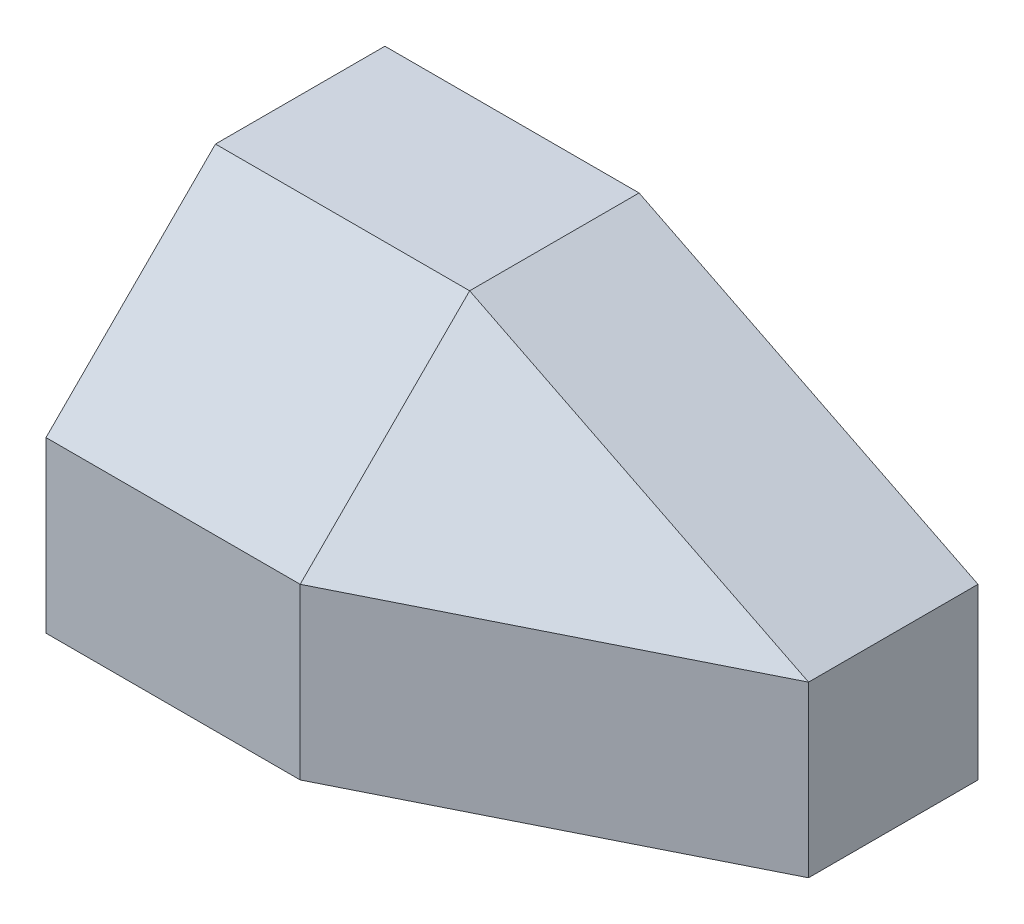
ISO-10303-21;
HEADER;
FILE_DESCRIPTION(('STEP AP214'),'2;1');
FILE_NAME('part.step','',(''),(''),'','','');
FILE_SCHEMA(('AUTOMOTIVE_DESIGN { 1 0 10303 214 1 1 1 1 }'));
ENDSEC;
DATA;
#1=APPLICATION_CONTEXT('core data for automotive mechanical design processes');
#2=APPLICATION_PROTOCOL_DEFINITION('international standard','automotive_design',2000,#1);
#3=PRODUCT_CONTEXT('',#1,'mechanical');
#4=PRODUCT('Part','Part','',(#3));
#5=PRODUCT_RELATED_PRODUCT_CATEGORY('part','',(#4));
#6=PRODUCT_DEFINITION_FORMATION('','',#4);
#7=PRODUCT_DEFINITION_CONTEXT('part definition',#1,'design');
#8=PRODUCT_DEFINITION('design','',#6,#7);
#9=PRODUCT_DEFINITION_SHAPE('','',#8);
#10=(LENGTH_UNIT() NAMED_UNIT(*) SI_UNIT(.MILLI.,.METRE.));
#11=(NAMED_UNIT(*) PLANE_ANGLE_UNIT() SI_UNIT($,.RADIAN.));
#12=(NAMED_UNIT(*) SI_UNIT($,.STERADIAN.) SOLID_ANGLE_UNIT());
#13=UNCERTAINTY_MEASURE_WITH_UNIT(LENGTH_MEASURE(1.E-05),#10,'distance_accuracy_value','');
#14=(GEOMETRIC_REPRESENTATION_CONTEXT(3) GLOBAL_UNCERTAINTY_ASSIGNED_CONTEXT((#13)) GLOBAL_UNIT_ASSIGNED_CONTEXT((#10,
#11,#12)) REPRESENTATION_CONTEXT('',''));
#15=CARTESIAN_POINT('',(0.,0.,0.));
#16=DIRECTION('',(0.,0.,1.));
#17=DIRECTION('',(1.,0.,0.));
#18=AXIS2_PLACEMENT_3D('',#15,#16,#17);
#19=CARTESIAN_POINT('',(29.9999999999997,40.,40.));
#20=DIRECTION('',(-0.447213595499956,0.,-0.894427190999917));
#21=DIRECTION('',(-0.894427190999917,0.,0.447213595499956));
#22=AXIS2_PLACEMENT_3D('',#19,#20,#21);
#23=PLANE('',#22);
#24=DIRECTION('',(0.,-1.,0.));
#25=VECTOR('',#24,1.);
#26=CARTESIAN_POINT('',(70.,0.,19.9999999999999));
#27=LINE('',#26,#25);
#28=CARTESIAN_POINT('',(70.,19.9999989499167,20.));
#29=VERTEX_POINT('',#28);
#30=CARTESIAN_POINT('',(70.,0.,19.9999999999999));
#31=VERTEX_POINT('',#30);
#32=EDGE_CURVE('E100',#29,#31,#27,.T.);
#33=ORIENTED_EDGE('',*,*,#32,.F.);
#34=DIRECTION('',(0.894427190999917,0.,-0.447213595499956));
#35=VECTOR('',#34,1.);
#36=CARTESIAN_POINT('',(29.9999999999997,19.9999989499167,40.));
#37=LINE('',#36,#35);
#38=CARTESIAN_POINT('',(29.9999999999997,19.9999999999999,40.));
#39=VERTEX_POINT('',#38);
#40=EDGE_CURVE('E11',#29,#39,#37,.F.);
#41=ORIENTED_EDGE('',*,*,#40,.T.);
#42=DIRECTION('',(0.,1.,0.));
#43=VECTOR('',#42,1.);
#44=CARTESIAN_POINT('',(29.9999999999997,40.,40.));
#45=LINE('',#44,#43);
#46=CARTESIAN_POINT('',(29.9999999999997,0.,40.));
#47=VERTEX_POINT('',#46);
#48=EDGE_CURVE('E103',#47,#39,#45,.T.);
#49=ORIENTED_EDGE('',*,*,#48,.F.);
#50=DIRECTION('',(0.894427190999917,0.,-0.447213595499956));
#51=VECTOR('',#50,1.);
#52=CARTESIAN_POINT('',(29.9999999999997,0.,40.));
#53=LINE('',#52,#51);
#54=EDGE_CURVE('E106',#31,#47,#53,.F.);
#55=ORIENTED_EDGE('',*,*,#54,.F.);
#56=EDGE_LOOP('',(#33,#41,#49,#55));
#57=FACE_BOUND('',#56,.T.);
#58=ADVANCED_FACE('F30',(#57),#23,.F.);
#59=CARTESIAN_POINT('',(29.9999999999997,40.,40.));
#60=DIRECTION('',(-0.447213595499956,-0.894427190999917,0.));
#61=DIRECTION('',(0.894427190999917,-0.447213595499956,0.));
#62=AXIS2_PLACEMENT_3D('',#59,#60,#61);
#63=PLANE('',#62);
#64=DIRECTION('',(0.,0.,-1.));
#65=VECTOR('',#64,1.);
#66=CARTESIAN_POINT('',(29.9999999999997,40.,40.));
#67=LINE('',#66,#65);
#68=CARTESIAN_POINT('',(29.9999999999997,40.,19.9999989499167));
#69=VERTEX_POINT('',#68);
#70=CARTESIAN_POINT('',(29.9999999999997,40.,0.));
#71=VERTEX_POINT('',#70);
#72=EDGE_CURVE('E45',#69,#71,#67,.T.);
#73=ORIENTED_EDGE('',*,*,#72,.F.);
#74=DIRECTION('',(-0.894427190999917,0.447213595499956,0.));
#75=VECTOR('',#74,1.);
#76=CARTESIAN_POINT('',(29.9999999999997,40.,19.9999989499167));
#77=LINE('',#76,#75);
#78=EDGE_CURVE('E38',#69,#29,#77,.F.);
#79=ORIENTED_EDGE('',*,*,#78,.T.);
#80=DIRECTION('',(0.,0.,1.));
#81=VECTOR('',#80,1.);
#82=CARTESIAN_POINT('',(70.,19.9999999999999,40.));
#83=LINE('',#82,#81);
#84=CARTESIAN_POINT('',(70.,19.9999999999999,0.));
#85=VERTEX_POINT('',#84);
#86=EDGE_CURVE('E97',#85,#29,#83,.T.);
#87=ORIENTED_EDGE('',*,*,#86,.F.);
#88=DIRECTION('',(-0.894427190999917,0.447213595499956,0.));
#89=VECTOR('',#88,1.);
#90=CARTESIAN_POINT('',(5.99999999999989,51.9999999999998,0.));
#91=LINE('',#90,#89);
#92=EDGE_CURVE('E52',#71,#85,#91,.F.);
#93=ORIENTED_EDGE('',*,*,#92,.F.);
#94=EDGE_LOOP('',(#73,#79,#87,#93));
#95=FACE_BOUND('',#94,.T.);
#96=ADVANCED_FACE('F32',(#95),#63,.F.);
#97=CARTESIAN_POINT('',(0.,19.9999999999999,40.));
#98=DIRECTION('',(0.,-0.707106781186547,-0.707106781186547));
#99=DIRECTION('',(0.,0.707106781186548,-0.707106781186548));
#100=AXIS2_PLACEMENT_3D('',#97,#98,#99);
#101=PLANE('',#100);
#102=DIRECTION('',(-1.,0.,0.));
#103=VECTOR('',#102,1.);
#104=CARTESIAN_POINT('',(0.,19.9999999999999,40.));
#105=LINE('',#104,#103);
#106=CARTESIAN_POINT('',(0.,19.9999999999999,40.));
#107=VERTEX_POINT('',#106);
#108=EDGE_CURVE('E119',#39,#107,#105,.T.);
#109=ORIENTED_EDGE('',*,*,#108,.F.);
#110=DIRECTION('',(0.,-0.707106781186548,0.707106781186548));
#111=VECTOR('',#110,1.);
#112=CARTESIAN_POINT('',(29.9999978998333,19.9999999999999,40.));
#113=LINE('',#112,#111);
#114=EDGE_CURVE('E89',#39,#69,#113,.F.);
#115=ORIENTED_EDGE('',*,*,#114,.T.);
#116=DIRECTION('',(1.,0.,0.));
#117=VECTOR('',#116,1.);
#118=CARTESIAN_POINT('',(0.,40.,19.9999999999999));
#119=LINE('',#118,#117);
#120=CARTESIAN_POINT('',(0.,40.,19.9999999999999));
#121=VERTEX_POINT('',#120);
#122=EDGE_CURVE('E118',#121,#69,#119,.T.);
#123=ORIENTED_EDGE('',*,*,#122,.F.);
#124=DIRECTION('',(0.,-0.707106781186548,0.707106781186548));
#125=VECTOR('',#124,1.);
#126=CARTESIAN_POINT('',(0.,19.9999999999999,40.));
#127=LINE('',#126,#125);
#128=EDGE_CURVE('E124',#107,#121,#127,.F.);
#129=ORIENTED_EDGE('',*,*,#128,.F.);
#130=EDGE_LOOP('',(#109,#115,#123,#129));
#131=FACE_BOUND('',#130,.T.);
#132=ADVANCED_FACE('F116',(#131),#101,.F.);
#133=CARTESIAN_POINT('',(0.,0.,40.));
#134=DIRECTION('',(1.,0.,0.));
#135=DIRECTION('',(0.,0.,-1.));
#136=AXIS2_PLACEMENT_3D('',#133,#134,#135);
#137=PLANE('',#136);
#138=DIRECTION('',(0.,-1.,0.));
#139=VECTOR('',#138,1.);
#140=CARTESIAN_POINT('',(0.,0.,40.));
#141=LINE('',#140,#139);
#142=CARTESIAN_POINT('',(0.,0.,40.));
#143=VERTEX_POINT('',#142);
#144=EDGE_CURVE('E138',#107,#143,#141,.T.);
#145=ORIENTED_EDGE('',*,*,#144,.F.);
#146=ORIENTED_EDGE('',*,*,#128,.T.);
#147=DIRECTION('',(0.,0.,-1.));
#148=VECTOR('',#147,1.);
#149=CARTESIAN_POINT('',(0.,40.,40.));
#150=LINE('',#149,#148);
#151=CARTESIAN_POINT('',(0.,40.,0.));
#152=VERTEX_POINT('',#151);
#153=EDGE_CURVE('E123',#121,#152,#150,.T.);
#154=ORIENTED_EDGE('',*,*,#153,.T.);
#155=DIRECTION('',(0.,-1.,0.));
#156=VECTOR('',#155,1.);
#157=CARTESIAN_POINT('',(0.,0.,0.));
#158=LINE('',#157,#156);
#159=CARTESIAN_POINT('',(0.,0.,0.));
#160=VERTEX_POINT('',#159);
#161=EDGE_CURVE('E143',#152,#160,#158,.T.);
#162=ORIENTED_EDGE('',*,*,#161,.T.);
#163=DIRECTION('',(0.,0.,-1.));
#164=VECTOR('',#163,1.);
#165=CARTESIAN_POINT('',(0.,0.,40.));
#166=LINE('',#165,#164);
#167=EDGE_CURVE('E129',#143,#160,#166,.T.);
#168=ORIENTED_EDGE('',*,*,#167,.F.);
#169=EDGE_LOOP('',(#145,#146,#154,#162,#168));
#170=FACE_BOUND('',#169,.T.);
#171=ADVANCED_FACE('F156',(#170),#137,.F.);
#172=CARTESIAN_POINT('',(0.,0.,40.));
#173=DIRECTION('',(0.,1.,0.));
#174=DIRECTION('',(0.,0.,1.));
#175=AXIS2_PLACEMENT_3D('',#172,#173,#174);
#176=PLANE('',#175);
#177=DIRECTION('',(0.,0.,-1.));
#178=VECTOR('',#177,1.);
#179=CARTESIAN_POINT('',(70.,0.,40.));
#180=LINE('',#179,#178);
#181=CARTESIAN_POINT('',(70.,0.,0.));
#182=VERTEX_POINT('',#181);
#183=EDGE_CURVE('E132',#31,#182,#180,.T.);
#184=ORIENTED_EDGE('',*,*,#183,.F.);
#185=ORIENTED_EDGE('',*,*,#54,.T.);
#186=DIRECTION('',(1.,0.,0.));
#187=VECTOR('',#186,1.);
#188=CARTESIAN_POINT('',(0.,0.,40.));
#189=LINE('',#188,#187);
#190=EDGE_CURVE('E135',#143,#47,#189,.T.);
#191=ORIENTED_EDGE('',*,*,#190,.F.);
#192=ORIENTED_EDGE('',*,*,#167,.T.);
#193=DIRECTION('',(1.,0.,0.));
#194=VECTOR('',#193,1.);
#195=CARTESIAN_POINT('',(0.,0.,0.));
#196=LINE('',#195,#194);
#197=EDGE_CURVE('E140',#160,#182,#196,.T.);
#198=ORIENTED_EDGE('',*,*,#197,.T.);
#199=EDGE_LOOP('',(#184,#185,#191,#192,#198));
#200=FACE_BOUND('',#199,.T.);
#201=ADVANCED_FACE('F155',(#200),#176,.F.);
#202=CARTESIAN_POINT('',(70.,0.,40.));
#203=DIRECTION('',(-1.,0.,0.));
#204=DIRECTION('',(0.,0.,1.));
#205=AXIS2_PLACEMENT_3D('',#202,#203,#204);
#206=PLANE('',#205);
#207=ORIENTED_EDGE('',*,*,#86,.T.);
#208=ORIENTED_EDGE('',*,*,#32,.T.);
#209=ORIENTED_EDGE('',*,*,#183,.T.);
#210=DIRECTION('',(0.,1.,0.));
#211=VECTOR('',#210,1.);
#212=CARTESIAN_POINT('',(70.,0.,0.));
#213=LINE('',#212,#211);
#214=EDGE_CURVE('E102',#182,#85,#213,.T.);
#215=ORIENTED_EDGE('',*,*,#214,.T.);
#216=EDGE_LOOP('',(#207,#208,#209,#215));
#217=FACE_BOUND('',#216,.T.);
#218=ADVANCED_FACE('F99',(#217),#206,.F.);
#219=CARTESIAN_POINT('',(0.,40.,40.));
#220=DIRECTION('',(0.,-1.,0.));
#221=DIRECTION('',(0.,0.,-1.));
#222=AXIS2_PLACEMENT_3D('',#219,#220,#221);
#223=PLANE('',#222);
#224=ORIENTED_EDGE('',*,*,#122,.T.);
#225=ORIENTED_EDGE('',*,*,#72,.T.);
#226=DIRECTION('',(-1.,0.,0.));
#227=VECTOR('',#226,1.);
#228=CARTESIAN_POINT('',(0.,40.,0.));
#229=LINE('',#228,#227);
#230=EDGE_CURVE('E136',#71,#152,#229,.T.);
#231=ORIENTED_EDGE('',*,*,#230,.T.);
#232=ORIENTED_EDGE('',*,*,#153,.F.);
#233=EDGE_LOOP('',(#224,#225,#231,#232));
#234=FACE_BOUND('',#233,.T.);
#235=ADVANCED_FACE('F121',(#234),#223,.F.);
#236=CARTESIAN_POINT('',(0.,40.,40.));
#237=DIRECTION('',(0.,0.,-1.));
#238=DIRECTION('',(-1.,0.,0.));
#239=AXIS2_PLACEMENT_3D('',#236,#237,#238);
#240=PLANE('',#239);
#241=ORIENTED_EDGE('',*,*,#190,.T.);
#242=ORIENTED_EDGE('',*,*,#48,.T.);
#243=ORIENTED_EDGE('',*,*,#108,.T.);
#244=ORIENTED_EDGE('',*,*,#144,.T.);
#245=EDGE_LOOP('',(#241,#242,#243,#244));
#246=FACE_BOUND('',#245,.T.);
#247=ADVANCED_FACE('F151',(#246),#240,.F.);
#248=CARTESIAN_POINT('',(0.,40.,0.));
#249=DIRECTION('',(0.,0.,-1.));
#250=DIRECTION('',(-1.,0.,0.));
#251=AXIS2_PLACEMENT_3D('',#248,#249,#250);
#252=PLANE('',#251);
#253=ORIENTED_EDGE('',*,*,#230,.F.);
#254=ORIENTED_EDGE('',*,*,#92,.T.);
#255=ORIENTED_EDGE('',*,*,#214,.F.);
#256=ORIENTED_EDGE('',*,*,#197,.F.);
#257=ORIENTED_EDGE('',*,*,#161,.F.);
#258=EDGE_LOOP('',(#253,#254,#255,#256,#257));
#259=FACE_BOUND('',#258,.T.);
#260=ADVANCED_FACE('F158',(#259),#252,.T.);
#261=CARTESIAN_POINT('',(29.8666645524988,19.9333322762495,40.1333343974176));
#262=DIRECTION('',(0.333333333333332,0.666666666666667,0.666666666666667));
#263=DIRECTION('',(0.,-0.707106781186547,0.707106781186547));
#264=AXIS2_PLACEMENT_3D('',#261,#262,#263);
#265=PLANE('',#264);
#266=ORIENTED_EDGE('',*,*,#114,.F.);
#267=ORIENTED_EDGE('',*,*,#40,.F.);
#268=ORIENTED_EDGE('',*,*,#78,.F.);
#269=EDGE_LOOP('',(#266,#267,#268));
#270=FACE_BOUND('',#269,.T.);
#271=ADVANCED_FACE('F87',(#270),#265,.T.);
#272=CLOSED_SHELL('',(#58,#96,#132,#171,#201,#218,#235,#247,#260,#271));
#273=MANIFOLD_SOLID_BREP('B2',#272);
#274=ADVANCED_BREP_SHAPE_REPRESENTATION('',(#18,#273),#14);
#275=SHAPE_DEFINITION_REPRESENTATION(#9,#274);
ENDSEC;
END-ISO-10303-21;
